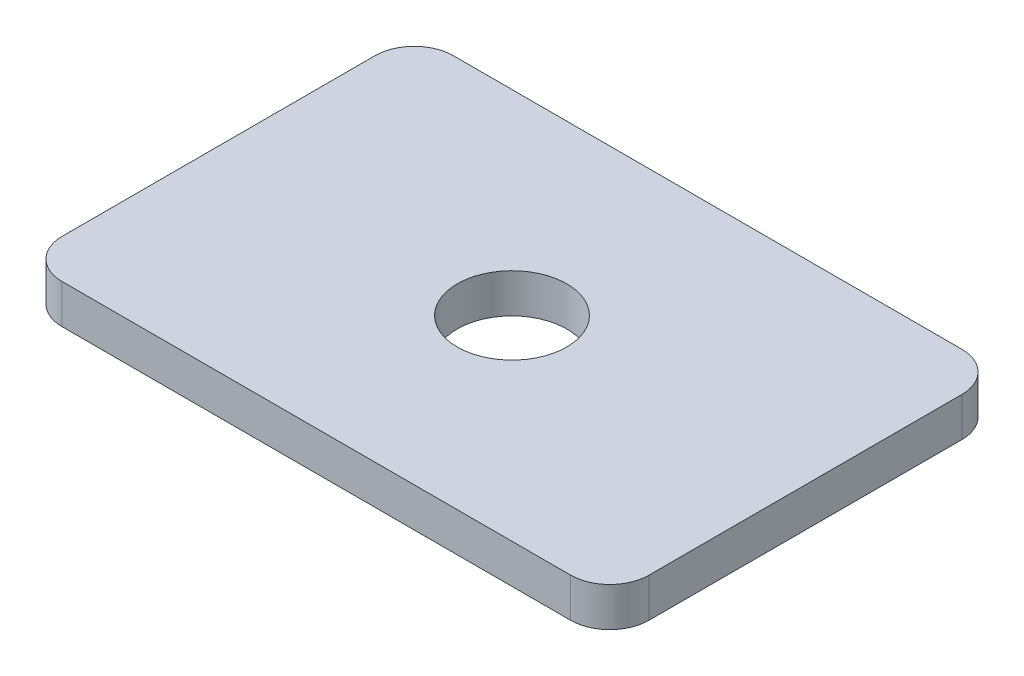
from build123d import *

# Parameters (mm, degrees)
SKETCH1_W          = 75
SKETCH1_H          = 50
EXTRUDE1_DEPTH     = 5
FILLET1_R          = 5
SKETCH4_R          = 7
CUT_EXTRUDE2_DEPTH = 46.345892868


with BuildPart() as part:
    # Sketch1 → Extrude1 (new body)
    with BuildSketch(Plane(origin=(0, 0, 0), x_dir=(1, 0, 0), z_dir=(0, 1, 0))):
        Rectangle(SKETCH1_W, SKETCH1_H)
    extrude(amount=EXTRUDE1_DEPTH)

    # Fillet1
    fillet1_edges = [part.edges().sort_by_distance(p)[0] for p in [
        (-37.5, 2.5, -25),
        (37.5, 2.5, -25),
        (37.5, 2.5, 25),
        (-37.5, 2.5, 25),
    ]]
    fillet(fillet1_edges, radius=FILLET1_R)

    # Sketch4 → Cut-Extrude2 (cut, through all)
    with BuildSketch(Plane(origin=(0, 5, 0), x_dir=(-1, 0, 0), z_dir=(0, 1, 0))):
        with Locations(Location((0, 0, 0), (0, 0, 90))):
            Circle(SKETCH4_R)
    extrude(amount=-CUT_EXTRUDE2_DEPTH, mode=Mode.SUBTRACT)


solid = part.part
